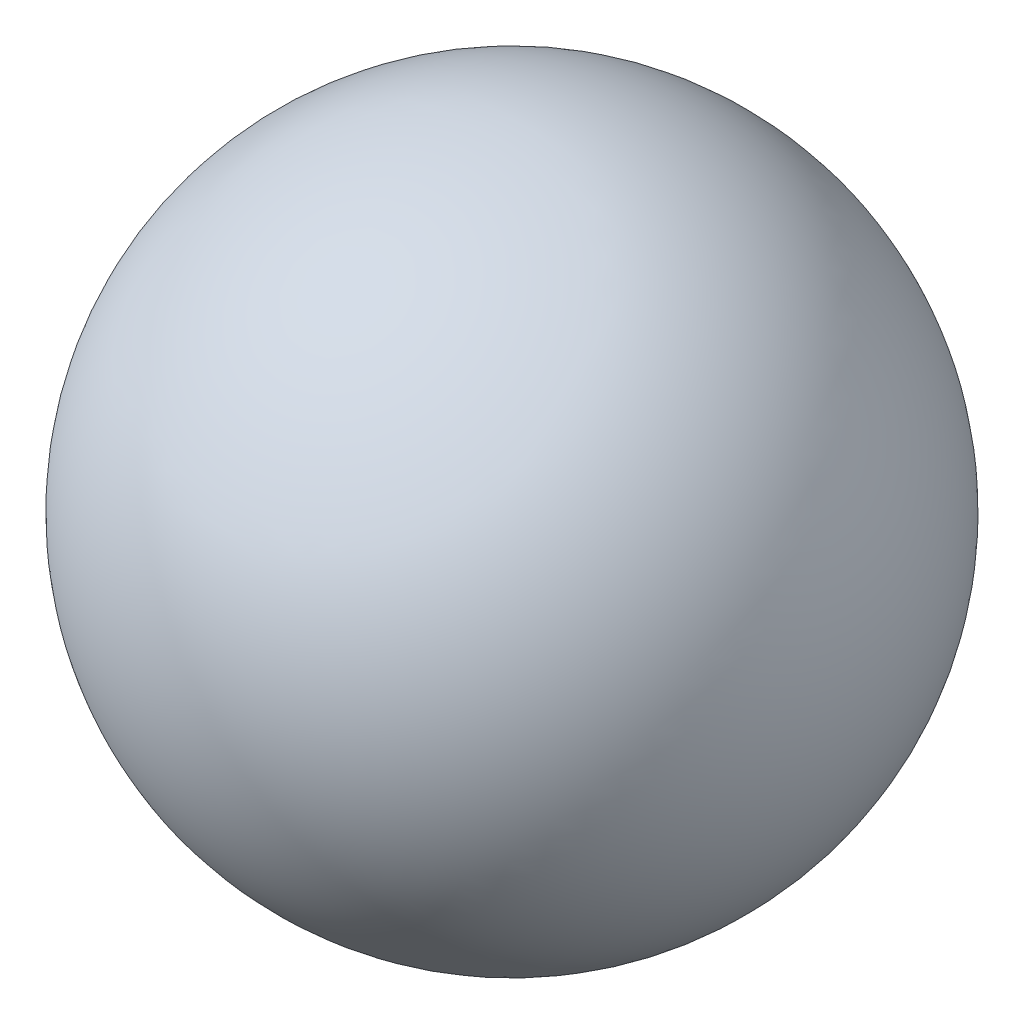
from build123d import *
from build123d.topology import SkipClean


with BuildPart() as part:
    # Sketch1 → Revolve1 (revolve)
    with SkipClean():  # the faces are left unmerged after this step: merging them gives an invalid solid
        with BuildSketch(Plane(origin=(0, 0, 0), x_dir=(1, 0, 0), z_dir=(0, 1, 0))):
            with BuildLine():
                ThreePointArc((7.9375, 0), (5.612660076, 5.612660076), (0, 7.9375))
                Line((0, 7.9375), (0, -7.9375))
                ThreePointArc((0, -7.9375), (5.612660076, -5.612660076), (7.9375, 0))
            make_face()
            with BuildLine():
                Line((0, -7.9375), (0, 7.9375))
                ThreePointArc((0, 7.9375), (-7.9375, 0), (0, -7.9375))
            make_face()
        revolve(axis=Axis((0, 0, -7.9375), (0, 0, 1)))


solid = part.part
